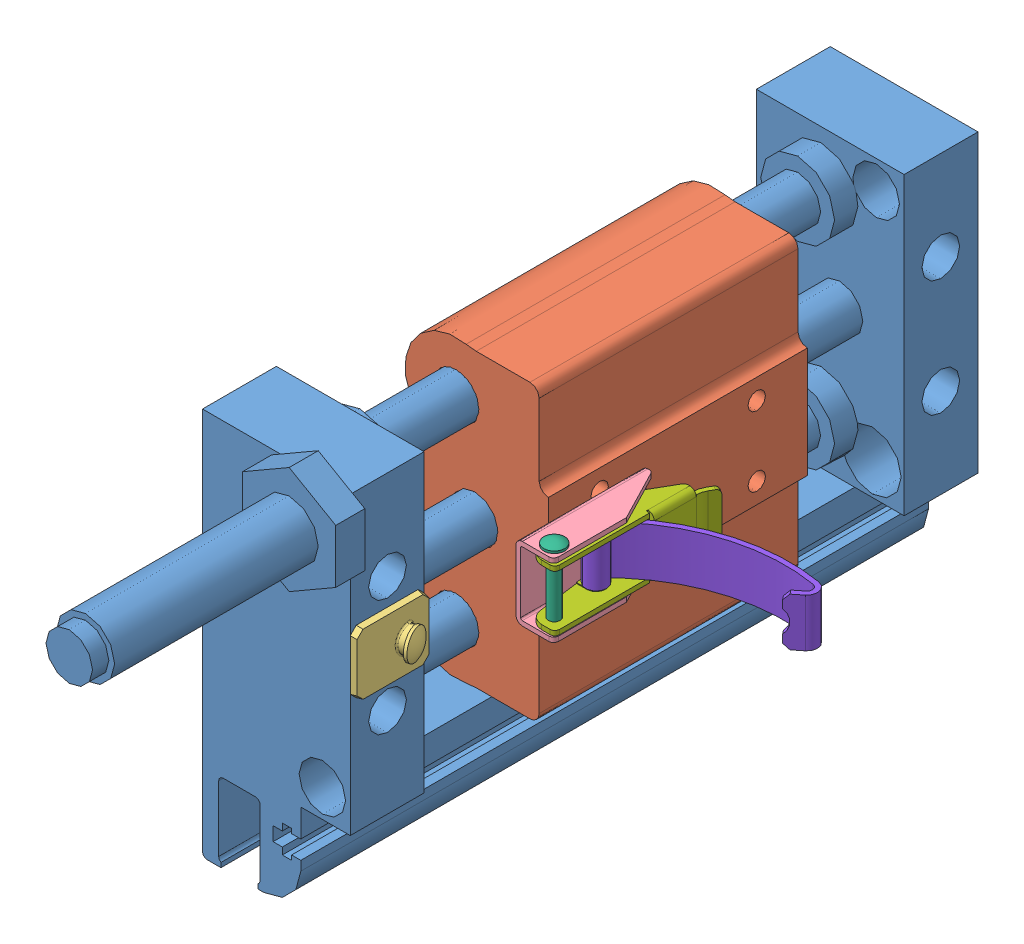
SolidWorks assembly Full latch mechanism.SLDASM, configuration Default (file format 11000). Lengths in mm.
Overall size (59.69 70.44 150.7).
8 component instances, 8 part files, 12 mates.
Components (placement in the parent):
- MainBody-1: MainBody.SLDPRT [Default] at origin size (27.9 70.44 150.7)
- Carriage-1: Carriage.SLDPRT [Default] at (0 -0.0151 -491.0195) x (0 1 0) z (0 0 -1) size (50.8 24.65 44.5)
- Keeper-1: Keeper.SLDPRT [Default] at (11.1 0 -107.9) x (0 0 1) z (1 0 0) size (12.7 10.8 3.56)
- Base-1: Base.sldprt [Default] at (6.322 0 -19.481) x (0 0 1) z (0 1 0) size (21.6 6.5 12.6)
- knurled_pin-1: knurled_pin.sldprt [Default] at (15.4956 -1.3358 -52.4075) x (0.770383 0 0.637582) z (0 1 0) size (1.96 1.96 10.4)
- Pin-1: Pin.sldprt [Default] at (18.9411 -18.831 -19.5711) x (0.39963 0 0.916677) z (0 1 0) size (3.6 3.6 13.98)
- Series Lever-1: Series Lever.sldprt [Default] at (6.3189 0 -19.4845) x (-0.000325 0 1) z (0 1 0) size (27.3 7.39 10.4)
- J_Spring-1: J_Spring.sldprt [Default] at (28.322 -0.075 -30.4033) x (0.947937 0 -0.318458) z (0 1 0) size (32.19 7.99 8.3)
Mates (geometry in assembly coordinates):
- Concentric1: concentric: circle of assembly; circle of assembly; circle of Carriage-1; circle of MainBody-1
- Concentric6: concentric: circle of assembly; circle of assembly; circle of knurled_pin-1; circle of J_Spring-1
- Concentric7: concentric: cylinder of assembly; cylinder of assembly; cylinder of Base-1 through (17.1 -6.3 -29.067) axis (0 1 0) radius 1.05; cylinder of Series Lever-1 through (17.1 5.2 -29.067) axis (0 -1 0) radius 1.05
- Lock1: lock: unknown of Carriage-1; unknown of Base-1
- Lock3: lock: unknown of Base-1; unknown of Pin-1
- Lock4: lock: unknown of knurled_pin-1; unknown of Series Lever-1
- Width3: width: plane of assembly; plane of assembly; plane of assembly; plane of assembly; plane of Base-1 through (20.2 -5.5 -26.867) normal (0 1 0); plane of Base-1 through (13.8 5.5 -26.867) normal (0 -1 0); plane of Series Lever-1 through (12.6986 4.4 -24.7685) normal (0 -1 0); plane of Series Lever-1 through (19.4986 -4.4 -24.7662) normal (0 1 0)
- Width4: width: plane of assembly; plane of assembly; plane of assembly; plane of assembly; plane of Base-1 through (20.2 -5.5 -26.867) normal (0 1 0); plane of Base-1 through (13.8 5.5 -26.867) normal (0 -1 0); plane of Series Lever-1 through (19.4986 -4.4 -24.7662) normal (0 1 0); plane of Series Lever-1 through (12.6986 4.4 -24.7685) normal (0 -1 0)
- Width5: width: plane of assembly; plane of assembly; plane of assembly; plane of assembly; plane of Base-1 through (20.2 -5.5 -26.867) normal (0 1 0); plane of Base-1 through (13.8 5.5 -26.867) normal (0 -1 0); plane of Series Lever-1 through (19.4986 -4.4 -24.7662) normal (0 1 0); plane of Series Lever-1 through (12.6986 4.4 -24.7685) normal (0 -1 0)
- Width6: width: plane of assembly; plane of assembly; plane of assembly; plane of assembly; plane of Base-1 through (20.2 -5.5 -26.867) normal (0 1 0); plane of Base-1 through (13.8 5.5 -26.867) normal (0 -1 0); plane of Series Lever-1 through (19.4986 -4.4 -24.7662) normal (0 1 0); plane of Series Lever-1 through (12.6986 4.4 -24.7685) normal (0 -1 0)
- Width7: width: plane of assembly; plane of assembly; plane of assembly; plane of assembly; plane of Base-1 through (20.2 -5.5 -26.867) normal (0 1 0); plane of Base-1 through (13.8 5.5 -26.867) normal (0 -1 0); plane of Series Lever-1 through (19.4986 -4.4 -24.7662) normal (0 1 0); plane of Series Lever-1 through (12.6986 4.4 -24.7685) normal (0 -1 0)
- Width8: width: plane of assembly; plane of assembly; plane of assembly; plane of assembly; plane of Base-1 through (20.2 -5.5 -26.867) normal (0 1 0); plane of Base-1 through (13.8 5.5 -26.867) normal (0 -1 0); plane of Series Lever-1 through (19.4986 -4.4 -24.7662) normal (0 1 0); plane of Series Lever-1 through (12.6986 4.4 -24.7685) normal (0 -1 0)
